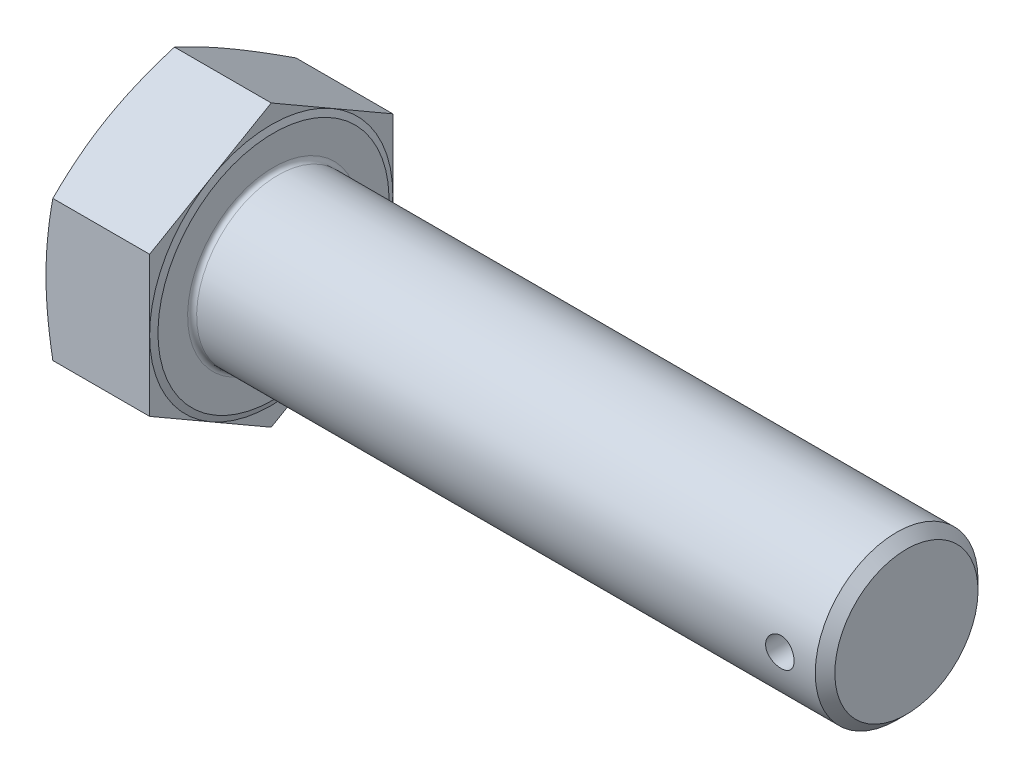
ISO-10303-21;
HEADER;
FILE_DESCRIPTION(('STEP AP214'),'2;1');
FILE_NAME('part.step','',(''),(''),'','','');
FILE_SCHEMA(('AUTOMOTIVE_DESIGN { 1 0 10303 214 1 1 1 1 }'));
ENDSEC;
DATA;
#1=APPLICATION_CONTEXT('core data for automotive mechanical design processes');
#2=APPLICATION_PROTOCOL_DEFINITION('international standard','automotive_design',2000,#1);
#3=PRODUCT_CONTEXT('',#1,'mechanical');
#4=PRODUCT('Part','Part','',(#3));
#5=PRODUCT_RELATED_PRODUCT_CATEGORY('part','',(#4));
#6=PRODUCT_DEFINITION_FORMATION('','',#4);
#7=PRODUCT_DEFINITION_CONTEXT('part definition',#1,'design');
#8=PRODUCT_DEFINITION('design','',#6,#7);
#9=PRODUCT_DEFINITION_SHAPE('','',#8);
#10=(LENGTH_UNIT() NAMED_UNIT(*) SI_UNIT(.MILLI.,.METRE.));
#11=(NAMED_UNIT(*) PLANE_ANGLE_UNIT() SI_UNIT($,.RADIAN.));
#12=(NAMED_UNIT(*) SI_UNIT($,.STERADIAN.) SOLID_ANGLE_UNIT());
#13=UNCERTAINTY_MEASURE_WITH_UNIT(LENGTH_MEASURE(1.E-05),#10,'distance_accuracy_value','');
#14=(GEOMETRIC_REPRESENTATION_CONTEXT(3) GLOBAL_UNCERTAINTY_ASSIGNED_CONTEXT((#13)) GLOBAL_UNIT_ASSIGNED_CONTEXT((#10,
#11,#12)) REPRESENTATION_CONTEXT('',''));
#15=CARTESIAN_POINT('',(0.,0.,0.));
#16=DIRECTION('',(0.,0.,1.));
#17=DIRECTION('',(1.,0.,0.));
#18=AXIS2_PLACEMENT_3D('',#15,#16,#17);
#19=CARTESIAN_POINT('',(23.42,0.,0.));
#20=DIRECTION('',(-1.,0.,0.));
#21=DIRECTION('',(0.,-1.,0.));
#22=AXIS2_PLACEMENT_3D('',#19,#20,#21);
#23=PLANE('',#22);
#24=CARTESIAN_POINT('',(23.42,0.,0.));
#25=DIRECTION('',(-1.,0.,0.));
#26=DIRECTION('',(0.,-1.,0.));
#27=AXIS2_PLACEMENT_3D('',#24,#25,#26);
#28=CIRCLE('',#27,19.);
#29=CARTESIAN_POINT('',(23.42,-19.,0.));
#30=VERTEX_POINT('',#29);
#31=EDGE_CURVE('E11',#30,#30,#28,.T.);
#32=ORIENTED_EDGE('',*,*,#31,.T.);
#33=EDGE_LOOP('',(#32));
#34=FACE_BOUND('',#33,.T.);
#35=CARTESIAN_POINT('',(23.42,0.,0.));
#36=DIRECTION('',(-1.,0.,0.));
#37=DIRECTION('',(0.,-1.,0.));
#38=AXIS2_PLACEMENT_3D('',#35,#36,#37);
#39=CIRCLE('',#38,25.555);
#40=CARTESIAN_POINT('',(23.42,-25.555,0.));
#41=VERTEX_POINT('',#40);
#42=EDGE_CURVE('E146',#41,#41,#39,.T.);
#43=ORIENTED_EDGE('',*,*,#42,.F.);
#44=EDGE_LOOP('',(#43));
#45=FACE_BOUND('',#44,.T.);
#46=ADVANCED_FACE('F32',(#34,#45),#23,.F.);
#47=CARTESIAN_POINT('',(22.92,0.,53.8));
#48=DIRECTION('',(-1.,0.,0.));
#49=DIRECTION('',(0.,0.,1.));
#50=AXIS2_PLACEMENT_3D('',#47,#48,#49);
#51=PLANE('',#50);
#52=DIRECTION('',(0.,-0.5,-0.866025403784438));
#53=VECTOR('',#52,1.);
#54=CARTESIAN_POINT('',(22.92,-15.5307222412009,26.9));
#55=LINE('',#54,#53);
#56=CARTESIAN_POINT('',(22.92,-15.5307222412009,26.9));
#57=VERTEX_POINT('',#56);
#58=CARTESIAN_POINT('',(22.92,-23.2960833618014,13.45));
#59=VERTEX_POINT('',#58);
#60=EDGE_CURVE('E145',#57,#59,#55,.T.);
#61=ORIENTED_EDGE('',*,*,#60,.T.);
#62=CARTESIAN_POINT('',(22.92,0.,0.));
#63=DIRECTION('',(-1.,0.,0.));
#64=DIRECTION('',(0.,-1.,0.));
#65=AXIS2_PLACEMENT_3D('',#62,#63,#64);
#66=CIRCLE('',#65,26.9);
#67=CARTESIAN_POINT('',(22.92,0.,26.9));
#68=VERTEX_POINT('',#67);
#69=EDGE_CURVE('E54',#59,#68,#66,.T.);
#70=ORIENTED_EDGE('',*,*,#69,.T.);
#71=DIRECTION('',(0.,-1.,0.));
#72=VECTOR('',#71,1.);
#73=CARTESIAN_POINT('',(22.92,15.530722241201,26.9));
#74=LINE('',#73,#72);
#75=EDGE_CURVE('E142',#68,#57,#74,.T.);
#76=ORIENTED_EDGE('',*,*,#75,.T.);
#77=EDGE_LOOP('',(#61,#70,#76));
#78=FACE_BOUND('',#77,.T.);
#79=ADVANCED_FACE('F141',(#78),#51,.F.);
#80=CARTESIAN_POINT('',(22.92,15.530722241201,26.9));
#81=VERTEX_POINT('',#80);
#82=EDGE_CURVE('E153',#81,#68,#74,.T.);
#83=ORIENTED_EDGE('',*,*,#82,.T.);
#84=CARTESIAN_POINT('',(22.92,23.2960833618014,13.45));
#85=VERTEX_POINT('',#84);
#86=EDGE_CURVE('E128',#68,#85,#66,.T.);
#87=ORIENTED_EDGE('',*,*,#86,.T.);
#88=DIRECTION('',(0.,-0.5,0.866025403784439));
#89=VECTOR('',#88,1.);
#90=CARTESIAN_POINT('',(22.92,31.0614444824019,0.));
#91=LINE('',#90,#89);
#92=EDGE_CURVE('E159',#85,#81,#91,.T.);
#93=ORIENTED_EDGE('',*,*,#92,.T.);
#94=EDGE_LOOP('',(#83,#87,#93));
#95=FACE_BOUND('',#94,.T.);
#96=ADVANCED_FACE('F158',(#95),#51,.F.);
#97=CARTESIAN_POINT('',(22.92,31.0614444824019,0.));
#98=VERTEX_POINT('',#97);
#99=EDGE_CURVE('E156',#98,#85,#91,.T.);
#100=ORIENTED_EDGE('',*,*,#99,.T.);
#101=CARTESIAN_POINT('',(22.92,23.2960833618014,-13.45));
#102=VERTEX_POINT('',#101);
#103=EDGE_CURVE('E132',#85,#102,#66,.T.);
#104=ORIENTED_EDGE('',*,*,#103,.T.);
#105=DIRECTION('',(0.,0.5,0.866025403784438));
#106=VECTOR('',#105,1.);
#107=CARTESIAN_POINT('',(22.92,15.530722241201,-26.9));
#108=LINE('',#107,#106);
#109=EDGE_CURVE('E325',#102,#98,#108,.T.);
#110=ORIENTED_EDGE('',*,*,#109,.T.);
#111=EDGE_LOOP('',(#100,#104,#110));
#112=FACE_BOUND('',#111,.T.);
#113=ADVANCED_FACE('F314',(#112),#51,.F.);
#114=CARTESIAN_POINT('',(22.92,15.530722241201,-26.9));
#115=VERTEX_POINT('',#114);
#116=EDGE_CURVE('E328',#115,#102,#108,.T.);
#117=ORIENTED_EDGE('',*,*,#116,.T.);
#118=CARTESIAN_POINT('',(22.92,0.,-26.9));
#119=VERTEX_POINT('',#118);
#120=EDGE_CURVE('E386',#102,#119,#66,.T.);
#121=ORIENTED_EDGE('',*,*,#120,.T.);
#122=DIRECTION('',(0.,1.,0.));
#123=VECTOR('',#122,1.);
#124=CARTESIAN_POINT('',(22.92,-15.5307222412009,-26.9));
#125=LINE('',#124,#123);
#126=EDGE_CURVE('E326',#119,#115,#125,.T.);
#127=ORIENTED_EDGE('',*,*,#126,.T.);
#128=EDGE_LOOP('',(#117,#121,#127));
#129=FACE_BOUND('',#128,.T.);
#130=ADVANCED_FACE('F307',(#129),#51,.F.);
#131=CARTESIAN_POINT('',(22.92,-15.5307222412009,-26.9));
#132=VERTEX_POINT('',#131);
#133=EDGE_CURVE('E319',#132,#119,#125,.T.);
#134=ORIENTED_EDGE('',*,*,#133,.T.);
#135=CARTESIAN_POINT('',(22.92,-23.2960833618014,-13.45));
#136=VERTEX_POINT('',#135);
#137=EDGE_CURVE('E320',#119,#136,#66,.T.);
#138=ORIENTED_EDGE('',*,*,#137,.T.);
#139=DIRECTION('',(0.,0.5,-0.866025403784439));
#140=VECTOR('',#139,1.);
#141=CARTESIAN_POINT('',(22.92,-31.0614444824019,0.));
#142=LINE('',#141,#140);
#143=EDGE_CURVE('E322',#136,#132,#142,.T.);
#144=ORIENTED_EDGE('',*,*,#143,.T.);
#145=EDGE_LOOP('',(#134,#138,#144));
#146=FACE_BOUND('',#145,.T.);
#147=ADVANCED_FACE('F299',(#146),#51,.F.);
#148=CARTESIAN_POINT('',(22.92,-15.5307222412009,26.9));
#149=DIRECTION('',(0.,0.866025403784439,-0.5));
#150=DIRECTION('',(0.,0.5,0.866025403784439));
#151=AXIS2_PLACEMENT_3D('',#148,#149,#150);
#152=PLANE('',#151);
#153=CARTESIAN_POINT('',(1.51468395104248,-31.0615599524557,-0.000199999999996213));
#154=CARTESIAN_POINT('',(1.397628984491,-30.739929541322,0.556880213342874));
#155=CARTESIAN_POINT('',(1.2858383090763,-30.4178264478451,1.11477913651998));
#156=CARTESIAN_POINT('',(1.07394359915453,-29.7726310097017,2.23229041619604));
#157=CARTESIAN_POINT('',(0.973840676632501,-29.4495385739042,2.79190293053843));
#158=CARTESIAN_POINT('',(0.692703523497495,-28.4783559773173,4.47404053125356));
#159=CARTESIAN_POINT('',(0.531005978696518,-27.8288051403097,5.5990955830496));
#160=CARTESIAN_POINT('',(0.33449307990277,-26.8553014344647,7.28525346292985));
#161=CARTESIAN_POINT('',(0.276827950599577,-26.5324717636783,7.84441085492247));
#162=CARTESIAN_POINT('',(0.177241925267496,-25.8861947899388,8.96379540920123));
#163=CARTESIAN_POINT('',(0.135321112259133,-25.5627474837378,9.52402257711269));
#164=CARTESIAN_POINT('',(0.067960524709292,-24.9155418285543,10.6450156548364));
#165=CARTESIAN_POINT('',(0.0425147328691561,-24.5917836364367,11.2057812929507));
#166=CARTESIAN_POINT('',(0.00853449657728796,-23.9440447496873,12.3276979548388));
#167=CARTESIAN_POINT('',(0.,-23.6200640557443,12.8888489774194));
#168=CARTESIAN_POINT('',(0.,-22.9721026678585,14.0111510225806));
#169=CARTESIAN_POINT('',(0.00853449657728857,-22.6481219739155,14.5723020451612));
#170=CARTESIAN_POINT('',(0.0425147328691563,-22.0003830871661,15.6942187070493));
#171=CARTESIAN_POINT('',(0.0679605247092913,-21.6766248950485,16.2549843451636));
#172=CARTESIAN_POINT('',(0.135321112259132,-21.029419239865,17.3759774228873));
#173=CARTESIAN_POINT('',(0.177241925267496,-20.705971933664,17.9362045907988));
#174=CARTESIAN_POINT('',(0.276827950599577,-20.0596949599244,19.0555891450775));
#175=CARTESIAN_POINT('',(0.334493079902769,-19.7368652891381,19.6147465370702));
#176=CARTESIAN_POINT('',(0.531005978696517,-18.7633615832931,21.3009044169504));
#177=CARTESIAN_POINT('',(0.692703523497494,-18.1138107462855,22.4259594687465));
#178=CARTESIAN_POINT('',(0.9738406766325,-17.1426281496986,24.1080970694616));
#179=CARTESIAN_POINT('',(1.07394359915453,-16.8195357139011,24.667709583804));
#180=CARTESIAN_POINT('',(1.28583830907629,-16.1743402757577,25.78522086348));
#181=CARTESIAN_POINT('',(1.39762898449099,-15.8522371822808,26.3431197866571));
#182=CARTESIAN_POINT('',(1.51468395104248,-15.5306067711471,26.9002));
#183=B_SPLINE_CURVE_WITH_KNOTS('',3,(#153,#154,#155,#156,#157,#158,#159,#160,#161,#162,#163,
#164,#165,#166,#167,#168,#169,#170,#171,#172,#173,#174,#175,#176,#177,#178,#179,#180,#181,#182),
.UNSPECIFIED.,.F.,.F.,(4,2,2,2,2,2,2,2,2,2,2,2,2,2,4),(0.,1.96141494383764,3.92301634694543,
7.84893078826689,9.79346540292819,11.7380102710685,13.6818445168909,15.6256727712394,
17.569501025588,19.5133352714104,21.4578801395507,23.402414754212,27.3283291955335,
29.2899305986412,31.2513455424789),.UNSPECIFIED.);
#184=CARTESIAN_POINT('',(1.51464192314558,-31.0614444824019,0.));
#185=VERTEX_POINT('',#184);
#186=CARTESIAN_POINT('',(0.,-23.2960833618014,13.45));
#187=VERTEX_POINT('',#186);
#188=EDGE_CURVE('E367',#185,#187,#183,.T.);
#189=ORIENTED_EDGE('',*,*,#188,.F.);
#190=DIRECTION('',(-1.,0.,0.));
#191=VECTOR('',#190,1.);
#192=CARTESIAN_POINT('',(22.92,-31.0614444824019,0.));
#193=LINE('',#192,#191);
#194=CARTESIAN_POINT('',(22.92,-31.0614444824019,0.));
#195=VERTEX_POINT('',#194);
#196=EDGE_CURVE('E176',#195,#185,#193,.T.);
#197=ORIENTED_EDGE('',*,*,#196,.F.);
#198=EDGE_CURVE('E375',#59,#195,#55,.T.);
#199=ORIENTED_EDGE('',*,*,#198,.F.);
#200=ORIENTED_EDGE('',*,*,#60,.F.);
#201=DIRECTION('',(-1.,0.,0.));
#202=VECTOR('',#201,1.);
#203=CARTESIAN_POINT('',(22.92,-15.5307222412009,26.9));
#204=LINE('',#203,#202);
#205=CARTESIAN_POINT('',(1.51464192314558,-15.530722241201,26.9));
#206=VERTEX_POINT('',#205);
#207=EDGE_CURVE('E155',#57,#206,#204,.T.);
#208=ORIENTED_EDGE('',*,*,#207,.T.);
#209=EDGE_CURVE('E256',#187,#206,#183,.T.);
#210=ORIENTED_EDGE('',*,*,#209,.F.);
#211=EDGE_LOOP('',(#189,#197,#199,#200,#208,#210));
#212=FACE_BOUND('',#211,.T.);
#213=ADVANCED_FACE('F34',(#212),#152,.F.);
#214=CARTESIAN_POINT('',(22.92,-31.0614444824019,0.));
#215=DIRECTION('',(0.,0.866025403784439,0.5));
#216=DIRECTION('',(0.,-0.5,0.866025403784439));
#217=AXIS2_PLACEMENT_3D('',#214,#215,#216);
#218=PLANE('',#217);
#219=CARTESIAN_POINT('',(1.51468395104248,-15.5306067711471,-26.9002));
#220=CARTESIAN_POINT('',(1.397628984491,-15.8522371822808,-26.3431197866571));
#221=CARTESIAN_POINT('',(1.2858383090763,-16.1743402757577,-25.78522086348));
#222=CARTESIAN_POINT('',(1.07394359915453,-16.8195357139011,-24.667709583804));
#223=CARTESIAN_POINT('',(0.9738406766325,-17.1426281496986,-24.1080970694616));
#224=CARTESIAN_POINT('',(0.692703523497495,-18.1138107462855,-22.4259594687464));
#225=CARTESIAN_POINT('',(0.531005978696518,-18.7633615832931,-21.3009044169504));
#226=CARTESIAN_POINT('',(0.334493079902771,-19.7368652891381,-19.6147465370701));
#227=CARTESIAN_POINT('',(0.276827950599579,-20.0596949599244,-19.0555891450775));
#228=CARTESIAN_POINT('',(0.177241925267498,-20.705971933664,-17.9362045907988));
#229=CARTESIAN_POINT('',(0.135321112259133,-21.029419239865,-17.3759774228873));
#230=CARTESIAN_POINT('',(0.0679605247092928,-21.6766248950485,-16.2549843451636));
#231=CARTESIAN_POINT('',(0.0425147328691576,-22.0003830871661,-15.6942187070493));
#232=CARTESIAN_POINT('',(0.00853449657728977,-22.6481219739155,-14.5723020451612));
#233=CARTESIAN_POINT('',(0.,-22.9721026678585,-14.0111510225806));
#234=CARTESIAN_POINT('',(0.,-23.6200640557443,-12.8888489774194));
#235=CARTESIAN_POINT('',(0.00853449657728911,-23.9440447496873,-12.3276979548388));
#236=CARTESIAN_POINT('',(0.0425147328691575,-24.5917836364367,-11.2057812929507));
#237=CARTESIAN_POINT('',(0.0679605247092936,-24.9155418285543,-10.6450156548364));
#238=CARTESIAN_POINT('',(0.135321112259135,-25.5627474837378,-9.52402257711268));
#239=CARTESIAN_POINT('',(0.177241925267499,-25.8861947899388,-8.96379540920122));
#240=CARTESIAN_POINT('',(0.27682795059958,-26.5324717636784,-7.84441085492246));
#241=CARTESIAN_POINT('',(0.334493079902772,-26.8553014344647,-7.28525346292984));
#242=CARTESIAN_POINT('',(0.531005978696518,-27.8288051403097,-5.59909558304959));
#243=CARTESIAN_POINT('',(0.692703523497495,-28.4783559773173,-4.47404053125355));
#244=CARTESIAN_POINT('',(0.973840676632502,-29.4495385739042,-2.79190293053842));
#245=CARTESIAN_POINT('',(1.07394359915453,-29.7726310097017,-2.23229041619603));
#246=CARTESIAN_POINT('',(1.2858383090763,-30.4178264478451,-1.11477913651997));
#247=CARTESIAN_POINT('',(1.397628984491,-30.739929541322,-0.556880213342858));
#248=CARTESIAN_POINT('',(1.51468395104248,-31.0615599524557,0.000200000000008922));
#249=B_SPLINE_CURVE_WITH_KNOTS('',3,(#219,#220,#221,#222,#223,#224,#225,#226,#227,#228,#229,
#230,#231,#232,#233,#234,#235,#236,#237,#238,#239,#240,#241,#242,#243,#244,#245,#246,#247,#248),
.UNSPECIFIED.,.F.,.F.,(4,2,2,2,2,2,2,2,2,2,2,2,2,2,4),(0.,1.96141494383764,3.92301634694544,
7.84893078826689,9.79346540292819,11.7380102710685,13.6818445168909,15.6256727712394,
17.569501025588,19.5133352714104,21.4578801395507,23.402414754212,27.3283291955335,
29.2899305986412,31.2513455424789),.UNSPECIFIED.);
#250=CARTESIAN_POINT('',(1.51464192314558,-15.530722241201,-26.9));
#251=VERTEX_POINT('',#250);
#252=CARTESIAN_POINT('',(0.,-23.2960833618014,-13.45));
#253=VERTEX_POINT('',#252);
#254=EDGE_CURVE('E271',#251,#253,#249,.T.);
#255=ORIENTED_EDGE('',*,*,#254,.F.);
#256=DIRECTION('',(-1.,0.,0.));
#257=VECTOR('',#256,1.);
#258=CARTESIAN_POINT('',(22.92,-15.5307222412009,-26.9));
#259=LINE('',#258,#257);
#260=EDGE_CURVE('E173',#132,#251,#259,.T.);
#261=ORIENTED_EDGE('',*,*,#260,.F.);
#262=ORIENTED_EDGE('',*,*,#143,.F.);
#263=EDGE_CURVE('E329',#195,#136,#142,.T.);
#264=ORIENTED_EDGE('',*,*,#263,.F.);
#265=ORIENTED_EDGE('',*,*,#196,.T.);
#266=EDGE_CURVE('E267',#253,#185,#249,.T.);
#267=ORIENTED_EDGE('',*,*,#266,.F.);
#268=EDGE_LOOP('',(#255,#261,#262,#264,#265,#267));
#269=FACE_BOUND('',#268,.T.);
#270=ADVANCED_FACE('F278',(#269),#218,.F.);
#271=CARTESIAN_POINT('',(22.92,-15.5307222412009,-26.9));
#272=DIRECTION('',(0.,0.,1.));
#273=DIRECTION('',(0.,-1.,0.));
#274=AXIS2_PLACEMENT_3D('',#271,#272,#273);
#275=PLANE('',#274);
#276=CARTESIAN_POINT('',(8.09364721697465,-41.1198962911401,-26.9));
#277=CARTESIAN_POINT('',(7.90830575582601,-40.5113784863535,-26.9));
#278=CARTESIAN_POINT('',(7.72408515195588,-39.90251948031,-26.9));
#279=CARTESIAN_POINT('',(7.35813658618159,-38.6840491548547,-26.9));
#280=CARTESIAN_POINT('',(7.17640863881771,-38.074437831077,-26.9));
#281=CARTESIAN_POINT('',(6.63531674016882,-36.2442909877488,-26.9));
#282=CARTESIAN_POINT('',(6.28007220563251,-35.0225325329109,-26.9));
#283=CARTESIAN_POINT('',(5.58244845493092,-32.5728740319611,-26.9));
#284=CARTESIAN_POINT('',(5.24009447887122,-31.3449667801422,-26.9));
#285=CARTESIAN_POINT('',(4.57223055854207,-28.8845851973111,-26.9));
#286=CARTESIAN_POINT('',(4.24672031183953,-27.6521109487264,-26.9));
#287=CARTESIAN_POINT('',(3.62060857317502,-25.1970031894,-26.9));
#288=CARTESIAN_POINT('',(3.31974945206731,-23.974435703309,-26.9));
#289=CARTESIAN_POINT('',(2.74364542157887,-21.5232168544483,-26.9));
#290=CARTESIAN_POINT('',(2.46840094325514,-20.2945653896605,-26.9));
#291=CARTESIAN_POINT('',(1.94994346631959,-17.8309048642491,-26.9));
#292=CARTESIAN_POINT('',(1.70671954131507,-16.5958981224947,-26.9));
#293=CARTESIAN_POINT('',(1.25971044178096,-14.1187108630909,-26.9));
#294=CARTESIAN_POINT('',(1.05592394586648,-12.8765305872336,-26.9));
#295=CARTESIAN_POINT('',(0.716241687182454,-10.5248875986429,-26.9));
#296=CARTESIAN_POINT('',(0.575295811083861,-9.41615979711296,-26.9));
#297=CARTESIAN_POINT('',(0.336719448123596,-7.19397286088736,-26.9));
#298=CARTESIAN_POINT('',(0.23908769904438,-6.08051386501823,-26.9));
#299=CARTESIAN_POINT('',(0.128594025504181,-4.40838527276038,-26.9));
#300=CARTESIAN_POINT('',(0.0977592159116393,-3.85086305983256,-26.9));
#301=CARTESIAN_POINT('',(0.0484240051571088,-2.73527749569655,-26.9));
#302=CARTESIAN_POINT('',(0.0299232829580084,-2.17721415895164,-26.9));
#303=CARTESIAN_POINT('',(0.00551073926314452,-1.06080794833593,-26.9));
#304=CARTESIAN_POINT('',(-0.000400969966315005,-0.50246507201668,-26.9));
#305=CARTESIAN_POINT('',(0.000443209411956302,0.61421121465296,-26.9));
#306=CARTESIAN_POINT('',(0.00719910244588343,1.17254462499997,-26.9));
#307=CARTESIAN_POINT('',(0.0333546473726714,2.29174015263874,-26.9));
#308=CARTESIAN_POINT('',(0.0528180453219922,2.85260078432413,-26.9));
#309=CARTESIAN_POINT('',(0.104179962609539,3.97375682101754,-26.9));
#310=CARTESIAN_POINT('',(0.136078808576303,4.53405221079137,-26.9));
#311=CARTESIAN_POINT('',(0.249841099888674,6.21369760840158,-26.9));
#312=CARTESIAN_POINT('',(0.349771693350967,7.33186346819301,-26.9));
#313=CARTESIAN_POINT('',(0.593196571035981,9.56430548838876,-26.9));
#314=CARTESIAN_POINT('',(0.73672827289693,10.6785774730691,-26.9));
#315=CARTESIAN_POINT('',(1.06151772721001,12.9015586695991,-26.9));
#316=CARTESIAN_POINT('',(1.2427756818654,14.010267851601,-26.9));
#317=CARTESIAN_POINT('',(1.64755285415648,16.2804505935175,-26.9));
#318=CARTESIAN_POINT('',(1.87280034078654,17.4416130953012,-26.9));
#319=CARTESIAN_POINT('',(2.35228571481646,19.7579761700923,-26.9));
#320=CARTESIAN_POINT('',(2.60652578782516,20.9131762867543,-26.9));
#321=CARTESIAN_POINT('',(3.13865814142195,23.2184366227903,-26.9));
#322=CARTESIAN_POINT('',(3.41655729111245,24.368495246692,-26.9));
#323=CARTESIAN_POINT('',(3.99148711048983,26.6637678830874,-26.9));
#324=CARTESIAN_POINT('',(4.2885173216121,27.8089820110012,-26.9));
#325=CARTESIAN_POINT('',(4.89852470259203,30.0967154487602,-26.9));
#326=CARTESIAN_POINT('',(5.21152186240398,31.2392294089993,-26.9));
#327=CARTESIAN_POINT('',(5.85024857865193,33.5206878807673,-26.9));
#328=CARTESIAN_POINT('',(6.17597818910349,34.6596323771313,-26.9));
#329=CARTESIAN_POINT('',(6.83783935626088,36.934281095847,-26.9));
#330=CARTESIAN_POINT('',(7.17396915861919,38.0699858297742,-26.9));
#331=CARTESIAN_POINT('',(7.85487572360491,40.3387931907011,-26.9));
#332=CARTESIAN_POINT('',(8.19965246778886,41.4718958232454,-26.9));
#333=CARTESIAN_POINT('',(8.89256632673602,43.7233823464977,-26.9));
#334=CARTESIAN_POINT('',(9.24062431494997,44.8417906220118,-26.9));
#335=CARTESIAN_POINT('',(9.94266917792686,47.0767430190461,-26.9));
#336=CARTESIAN_POINT('',(10.2966560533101,48.1932871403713,-26.9));
#337=CARTESIAN_POINT('',(11.0096682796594,50.4248205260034,-26.9));
#338=CARTESIAN_POINT('',(11.3686938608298,51.5398097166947,-26.9));
#339=CARTESIAN_POINT('',(12.0910290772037,53.7683997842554,-26.9));
#340=CARTESIAN_POINT('',(12.4543387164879,54.8820006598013,-26.9));
#341=CARTESIAN_POINT('',(13.183249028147,57.1037705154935,-26.9));
#342=CARTESIAN_POINT('',(13.5488357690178,58.2119440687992,-26.9));
#343=CARTESIAN_POINT('',(14.2831639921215,60.4272456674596,-26.9));
#344=CARTESIAN_POINT('',(14.6519054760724,61.5343737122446,-26.9));
#345=CARTESIAN_POINT('',(15.3920970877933,63.7476227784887,-26.9));
#346=CARTESIAN_POINT('',(15.7635469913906,64.8537438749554,-26.9));
#347=CARTESIAN_POINT('',(16.5088503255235,67.0651731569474,-26.9));
#348=CARTESIAN_POINT('',(16.8827037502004,68.170481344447,-26.9));
#349=CARTESIAN_POINT('',(17.2575923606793,69.2754374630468,-26.9));
#350=B_SPLINE_CURVE_WITH_KNOTS('',3,(#276,#277,#278,#279,#280,#281,#282,#283,#284,#285,#286,
#287,#288,#289,#290,#291,#292,#293,#294,#295,#296,#297,#298,#299,#300,#301,#302,#303,#304,#305,
#306,#307,#308,#309,#310,#311,#312,#313,#314,#315,#316,#317,#318,#319,#320,#321,#322,#323,#324,
#325,#326,#327,#328,#329,#330,#331,#332,#333,#334,#335,#336,#337,#338,#339,#340,#341,#342,#343,
#344,#345,#346,#347,#348,#349),.UNSPECIFIED.,.F.,.F.,(4,2,2,2,2,2,2,2,2,2,2,2,2,2,2,2,2,2,2,2,2,
2,2,2,2,2,2,2,2,2,2,2,2,2,2,2,4),(0.,1.90835024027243,3.81671160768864,7.63371645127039,
11.4578428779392,15.2819006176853,19.058809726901,22.8357823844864,26.6114628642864,
30.387016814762,33.7392585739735,37.0914026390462,38.7664112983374,40.4413763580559,
42.1163563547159,43.791336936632,45.4747851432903,47.1582775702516,50.5250926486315,
53.8948052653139,57.2645359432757,60.812508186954,64.3607480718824,67.9100216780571,
71.4592102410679,75.0129568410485,78.5667185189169,82.1198839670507,85.6730418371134,
89.186970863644,92.700900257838,96.214990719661,99.7290845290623,103.229839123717,
106.73059562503,110.231065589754,113.731527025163),.UNSPECIFIED.);
#351=CARTESIAN_POINT('',(1.51464192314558,15.5307222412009,-26.9));
#352=VERTEX_POINT('',#351);
#353=CARTESIAN_POINT('',(0.,0.,-26.9));
#354=VERTEX_POINT('',#353);
#355=EDGE_CURVE('E376',#352,#354,#350,.F.);
#356=ORIENTED_EDGE('',*,*,#355,.F.);
#357=DIRECTION('',(-1.,0.,0.));
#358=VECTOR('',#357,1.);
#359=CARTESIAN_POINT('',(22.92,15.530722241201,-26.9));
#360=LINE('',#359,#358);
#361=EDGE_CURVE('E170',#115,#352,#360,.T.);
#362=ORIENTED_EDGE('',*,*,#361,.F.);
#363=ORIENTED_EDGE('',*,*,#126,.F.);
#364=ORIENTED_EDGE('',*,*,#133,.F.);
#365=ORIENTED_EDGE('',*,*,#260,.T.);
#366=EDGE_CURVE('E272',#354,#251,#350,.F.);
#367=ORIENTED_EDGE('',*,*,#366,.F.);
#368=EDGE_LOOP('',(#356,#362,#363,#364,#365,#367));
#369=FACE_BOUND('',#368,.T.);
#370=ADVANCED_FACE('F281',(#369),#275,.F.);
#371=CARTESIAN_POINT('',(22.92,15.530722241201,-26.9));
#372=DIRECTION('',(0.,-0.866025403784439,0.5));
#373=DIRECTION('',(0.,-0.5,-0.866025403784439));
#374=AXIS2_PLACEMENT_3D('',#371,#372,#373);
#375=PLANE('',#374);
#376=CARTESIAN_POINT('',(1.51468395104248,31.0615599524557,0.000199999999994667));
#377=CARTESIAN_POINT('',(1.39762898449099,30.739929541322,-0.556880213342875));
#378=CARTESIAN_POINT('',(1.28583830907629,30.4178264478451,-1.11477913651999));
#379=CARTESIAN_POINT('',(1.07394359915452,29.7726310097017,-2.23229041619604));
#380=CARTESIAN_POINT('',(0.973840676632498,29.4495385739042,-2.79190293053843));
#381=CARTESIAN_POINT('',(0.692703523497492,28.4783559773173,-4.47404053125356));
#382=CARTESIAN_POINT('',(0.531005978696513,27.8288051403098,-5.5990955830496));
#383=CARTESIAN_POINT('',(0.334493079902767,26.8553014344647,-7.28525346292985));
#384=CARTESIAN_POINT('',(0.276827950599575,26.5324717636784,-7.84441085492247));
#385=CARTESIAN_POINT('',(0.177241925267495,25.8861947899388,-8.96379540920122));
#386=CARTESIAN_POINT('',(0.135321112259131,25.5627474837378,-9.52402257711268));
#387=CARTESIAN_POINT('',(0.0679605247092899,24.9155418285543,-10.6450156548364));
#388=CARTESIAN_POINT('',(0.0425147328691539,24.5917836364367,-11.2057812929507));
#389=CARTESIAN_POINT('',(0.00853449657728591,23.9440447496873,-12.3276979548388));
#390=CARTESIAN_POINT('',(0.,23.6200640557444,-12.8888489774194));
#391=CARTESIAN_POINT('',(0.,22.9721026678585,-14.0111510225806));
#392=CARTESIAN_POINT('',(0.0085344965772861,22.6481219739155,-14.5723020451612));
#393=CARTESIAN_POINT('',(0.0425147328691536,22.0003830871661,-15.6942187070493));
#394=CARTESIAN_POINT('',(0.067960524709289,21.6766248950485,-16.2549843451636));
#395=CARTESIAN_POINT('',(0.13532111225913,21.029419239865,-17.3759774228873));
#396=CARTESIAN_POINT('',(0.177241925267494,20.705971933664,-17.9362045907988));
#397=CARTESIAN_POINT('',(0.276827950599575,20.0596949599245,-19.0555891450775));
#398=CARTESIAN_POINT('',(0.334493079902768,19.7368652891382,-19.6147465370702));
#399=CARTESIAN_POINT('',(0.531005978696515,18.7633615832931,-21.3009044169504));
#400=CARTESIAN_POINT('',(0.692703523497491,18.1138107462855,-22.4259594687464));
#401=CARTESIAN_POINT('',(0.973840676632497,17.1426281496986,-24.1080970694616));
#402=CARTESIAN_POINT('',(1.07394359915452,16.8195357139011,-24.667709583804));
#403=CARTESIAN_POINT('',(1.28583830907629,16.1743402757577,-25.78522086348));
#404=CARTESIAN_POINT('',(1.39762898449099,15.8522371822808,-26.3431197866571));
#405=CARTESIAN_POINT('',(1.51468395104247,15.5306067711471,-26.9002));
#406=B_SPLINE_CURVE_WITH_KNOTS('',3,(#376,#377,#378,#379,#380,#381,#382,#383,#384,#385,#386,
#387,#388,#389,#390,#391,#392,#393,#394,#395,#396,#397,#398,#399,#400,#401,#402,#403,#404,#405),
.UNSPECIFIED.,.F.,.F.,(4,2,2,2,2,2,2,2,2,2,2,2,2,2,4),(0.,1.96141494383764,3.92301634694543,
7.84893078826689,9.79346540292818,11.7380102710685,13.6818445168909,15.6256727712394,
17.5695010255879,19.5133352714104,21.4578801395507,23.402414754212,27.3283291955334,
29.2899305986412,31.2513455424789),.UNSPECIFIED.);
#407=CARTESIAN_POINT('',(1.51464192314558,31.0614444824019,0.));
#408=VERTEX_POINT('',#407);
#409=CARTESIAN_POINT('',(0.,23.2960833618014,-13.45));
#410=VERTEX_POINT('',#409);
#411=EDGE_CURVE('E261',#408,#410,#406,.T.);
#412=ORIENTED_EDGE('',*,*,#411,.F.);
#413=DIRECTION('',(-1.,0.,0.));
#414=VECTOR('',#413,1.);
#415=CARTESIAN_POINT('',(22.92,31.0614444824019,0.));
#416=LINE('',#415,#414);
#417=EDGE_CURVE('E167',#98,#408,#416,.T.);
#418=ORIENTED_EDGE('',*,*,#417,.F.);
#419=ORIENTED_EDGE('',*,*,#109,.F.);
#420=ORIENTED_EDGE('',*,*,#116,.F.);
#421=ORIENTED_EDGE('',*,*,#361,.T.);
#422=EDGE_CURVE('E368',#410,#352,#406,.T.);
#423=ORIENTED_EDGE('',*,*,#422,.F.);
#424=EDGE_LOOP('',(#412,#418,#419,#420,#421,#423));
#425=FACE_BOUND('',#424,.T.);
#426=ADVANCED_FACE('F285',(#425),#375,.F.);
#427=CARTESIAN_POINT('',(22.92,31.0614444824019,0.));
#428=DIRECTION('',(0.,-0.866025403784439,-0.5));
#429=DIRECTION('',(0.,0.5,-0.866025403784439));
#430=AXIS2_PLACEMENT_3D('',#427,#428,#429);
#431=PLANE('',#430);
#432=CARTESIAN_POINT('',(1.51468395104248,15.5306067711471,26.9002));
#433=CARTESIAN_POINT('',(1.39762898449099,15.8522371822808,26.3431197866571));
#434=CARTESIAN_POINT('',(1.28583830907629,16.1743402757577,25.78522086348));
#435=CARTESIAN_POINT('',(1.07394359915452,16.8195357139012,24.667709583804));
#436=CARTESIAN_POINT('',(0.973840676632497,17.1426281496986,24.1080970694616));
#437=CARTESIAN_POINT('',(0.692703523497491,18.1138107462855,22.4259594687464));
#438=CARTESIAN_POINT('',(0.531005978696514,18.7633615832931,21.3009044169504));
#439=CARTESIAN_POINT('',(0.334493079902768,19.7368652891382,19.6147465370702));
#440=CARTESIAN_POINT('',(0.276827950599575,20.0596949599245,19.0555891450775));
#441=CARTESIAN_POINT('',(0.177241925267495,20.705971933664,17.9362045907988));
#442=CARTESIAN_POINT('',(0.135321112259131,21.029419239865,17.3759774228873));
#443=CARTESIAN_POINT('',(0.0679605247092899,21.6766248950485,16.2549843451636));
#444=CARTESIAN_POINT('',(0.0425147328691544,22.0003830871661,15.6942187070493));
#445=CARTESIAN_POINT('',(0.00853449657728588,22.6481219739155,14.5723020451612));
#446=CARTESIAN_POINT('',(0.,22.9721026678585,14.0111510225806));
#447=CARTESIAN_POINT('',(0.,23.6200640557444,12.8888489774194));
#448=CARTESIAN_POINT('',(0.00853449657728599,23.9440447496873,12.3276979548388));
#449=CARTESIAN_POINT('',(0.0425147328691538,24.5917836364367,11.2057812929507));
#450=CARTESIAN_POINT('',(0.0679605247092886,24.9155418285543,10.6450156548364));
#451=CARTESIAN_POINT('',(0.13532111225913,25.5627474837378,9.52402257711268));
#452=CARTESIAN_POINT('',(0.177241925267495,25.8861947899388,8.96379540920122));
#453=CARTESIAN_POINT('',(0.276827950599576,26.5324717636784,7.84441085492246));
#454=CARTESIAN_POINT('',(0.334493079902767,26.8553014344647,7.28525346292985));
#455=CARTESIAN_POINT('',(0.531005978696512,27.8288051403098,5.59909558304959));
#456=CARTESIAN_POINT('',(0.692703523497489,28.4783559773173,4.47404053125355));
#457=CARTESIAN_POINT('',(0.973840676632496,29.4495385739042,2.79190293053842));
#458=CARTESIAN_POINT('',(1.07394359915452,29.7726310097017,2.23229041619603));
#459=CARTESIAN_POINT('',(1.28583830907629,30.4178264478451,1.11477913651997));
#460=CARTESIAN_POINT('',(1.39762898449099,30.739929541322,0.556880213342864));
#461=CARTESIAN_POINT('',(1.51468395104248,31.0615599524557,-0.000200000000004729));
#462=B_SPLINE_CURVE_WITH_KNOTS('',3,(#432,#433,#434,#435,#436,#437,#438,#439,#440,#441,#442,
#443,#444,#445,#446,#447,#448,#449,#450,#451,#452,#453,#454,#455,#456,#457,#458,#459,#460,#461),
.UNSPECIFIED.,.F.,.F.,(4,2,2,2,2,2,2,2,2,2,2,2,2,2,4),(0.,1.96141494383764,3.92301634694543,
7.84893078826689,9.79346540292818,11.7380102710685,13.6818445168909,15.6256727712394,
17.569501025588,19.5133352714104,21.4578801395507,23.402414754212,27.3283291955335,
29.2899305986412,31.2513455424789),.UNSPECIFIED.);
#463=CARTESIAN_POINT('',(1.51464192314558,15.530722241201,26.9));
#464=VERTEX_POINT('',#463);
#465=CARTESIAN_POINT('',(0.,23.2960833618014,13.45));
#466=VERTEX_POINT('',#465);
#467=EDGE_CURVE('E249',#464,#466,#462,.T.);
#468=ORIENTED_EDGE('',*,*,#467,.F.);
#469=DIRECTION('',(-1.,0.,0.));
#470=VECTOR('',#469,1.);
#471=CARTESIAN_POINT('',(22.92,15.530722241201,26.9));
#472=LINE('',#471,#470);
#473=EDGE_CURVE('E161',#81,#464,#472,.T.);
#474=ORIENTED_EDGE('',*,*,#473,.F.);
#475=ORIENTED_EDGE('',*,*,#92,.F.);
#476=ORIENTED_EDGE('',*,*,#99,.F.);
#477=ORIENTED_EDGE('',*,*,#417,.T.);
#478=EDGE_CURVE('E360',#466,#408,#462,.T.);
#479=ORIENTED_EDGE('',*,*,#478,.F.);
#480=EDGE_LOOP('',(#468,#474,#475,#476,#477,#479));
#481=FACE_BOUND('',#480,.T.);
#482=ADVANCED_FACE('F289',(#481),#431,.F.);
#483=CARTESIAN_POINT('',(22.92,15.530722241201,26.9));
#484=DIRECTION('',(0.,0.,-1.));
#485=DIRECTION('',(-1.,0.,0.));
#486=AXIS2_PLACEMENT_3D('',#483,#484,#485);
#487=PLANE('',#486);
#488=CARTESIAN_POINT('',(8.09364576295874,-41.1198915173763,26.9));
#489=CARTESIAN_POINT('',(7.90830433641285,-40.5113738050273,26.9));
#490=CARTESIAN_POINT('',(7.72408376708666,-39.9025148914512,26.9));
#491=CARTESIAN_POINT('',(7.35813527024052,-38.6840447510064,26.9));
#492=CARTESIAN_POINT('',(7.17640735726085,-38.0744335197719,26.9));
#493=CARTESIAN_POINT('',(6.63531556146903,-36.2442869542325,26.9));
#494=CARTESIAN_POINT('',(6.28007109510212,-35.0225286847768,26.9));
#495=CARTESIAN_POINT('',(5.58244747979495,-32.5728705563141,26.9));
#496=CARTESIAN_POINT('',(5.24009357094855,-31.3449634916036,26.9));
#497=CARTESIAN_POINT('',(4.5722297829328,-28.8845822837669,26.9));
#498=CARTESIAN_POINT('',(4.24671960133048,-27.6521082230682,26.9));
#499=CARTESIAN_POINT('',(3.62060798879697,-25.1970008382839,26.9));
#500=CARTESIAN_POINT('',(3.31974892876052,-23.9744335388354,26.9));
#501=CARTESIAN_POINT('',(2.74364501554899,-21.5232150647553,26.9));
#502=CARTESIAN_POINT('',(2.46840059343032,-20.2945637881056,26.9));
#503=CARTESIAN_POINT('',(1.94994322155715,-17.830903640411,26.9));
#504=CARTESIAN_POINT('',(1.70671934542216,-16.5958970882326,26.9));
#505=CARTESIAN_POINT('',(1.2597103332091,-14.118710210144,26.9));
#506=CARTESIAN_POINT('',(1.05592387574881,-12.8765301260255,26.9));
#507=CARTESIAN_POINT('',(0.716241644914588,-10.5248872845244,26.9));
#508=CARTESIAN_POINT('',(0.575295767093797,-9.41615943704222,26.9));
#509=CARTESIAN_POINT('',(0.336719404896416,-7.19397240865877,26.9));
#510=CARTESIAN_POINT('',(0.239087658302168,-6.080513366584,26.9));
#511=CARTESIAN_POINT('',(0.128593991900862,-4.40838470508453,26.9));
#512=CARTESIAN_POINT('',(0.0977591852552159,-3.85086246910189,26.9));
#513=CARTESIAN_POINT('',(0.0484239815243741,-2.73527685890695,26.9));
#514=CARTESIAN_POINT('',(0.0299232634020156,-2.17721349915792,26.9));
#515=CARTESIAN_POINT('',(0.00551072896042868,-1.06080724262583,26.9));
#516=CARTESIAN_POINT('',(-0.000400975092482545,-0.502464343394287,26.9));
#517=CARTESIAN_POINT('',(0.00044321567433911,0.614211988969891,26.9));
#518=CARTESIAN_POINT('',(0.00719911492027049,1.17254542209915,26.9));
#519=CARTESIAN_POINT('',(0.0333546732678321,2.29174099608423,26.9));
#520=CARTESIAN_POINT('',(0.0528180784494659,2.85260165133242,26.9));
#521=CARTESIAN_POINT('',(0.104180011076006,3.97375773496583,26.9));
#522=CARTESIAN_POINT('',(0.136078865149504,4.53405314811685,26.9));
#523=CARTESIAN_POINT('',(0.249841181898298,6.21369861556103,26.9));
#524=CARTESIAN_POINT('',(0.349771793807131,7.33186452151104,26.9));
#525=CARTESIAN_POINT('',(0.59319671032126,9.56430663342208,26.9));
#526=CARTESIAN_POINT('',(0.736728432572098,10.6785786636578,26.9));
#527=CARTESIAN_POINT('',(1.06151792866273,12.9015599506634,26.9));
#528=CARTESIAN_POINT('',(1.24277590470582,14.0102691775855,26.9));
#529=CARTESIAN_POINT('',(1.6475531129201,16.2804519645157,26.9));
#530=CARTESIAN_POINT('',(1.87280061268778,17.4416144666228,26.9));
#531=CARTESIAN_POINT('',(2.35228601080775,19.7579775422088,26.9));
#532=CARTESIAN_POINT('',(2.60652609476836,20.9131776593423,26.9));
#533=CARTESIAN_POINT('',(3.13865846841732,23.2184379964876,26.9));
#534=CARTESIAN_POINT('',(3.41655762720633,24.3684966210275,26.9));
#535=CARTESIAN_POINT('',(3.99148746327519,26.663769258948,26.9));
#536=CARTESIAN_POINT('',(4.28851768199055,27.8089833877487,26.9));
#537=CARTESIAN_POINT('',(4.89852507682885,30.0967168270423,26.9));
#538=CARTESIAN_POINT('',(5.21152224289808,31.2392307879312,26.9));
#539=CARTESIAN_POINT('',(5.85024897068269,33.5206892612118,26.9));
#540=CARTESIAN_POINT('',(6.17597858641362,34.6596337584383,26.9));
#541=CARTESIAN_POINT('',(6.83783976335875,36.9342824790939,26.9));
#542=CARTESIAN_POINT('',(7.17396957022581,38.069987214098,26.9));
#543=CARTESIAN_POINT('',(7.85487614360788,40.3387945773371,26.9));
#544=CARTESIAN_POINT('',(8.19965289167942,41.4718972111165,26.9));
#545=CARTESIAN_POINT('',(8.89256675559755,43.7233837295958,26.9));
#546=CARTESIAN_POINT('',(9.24062474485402,44.8417919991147,26.9));
#547=CARTESIAN_POINT('',(9.94266960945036,47.0767443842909,26.9));
#548=CARTESIAN_POINT('',(10.2966564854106,48.1932884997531,26.9));
#549=CARTESIAN_POINT('',(11.009668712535,50.4248218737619,26.9));
#550=CARTESIAN_POINT('',(11.3686942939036,51.5398110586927,26.9));
#551=CARTESIAN_POINT('',(12.0910295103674,53.7684011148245,26.9));
#552=CARTESIAN_POINT('',(12.4543391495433,54.882001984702,26.9));
#553=CARTESIAN_POINT('',(13.1832494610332,57.1037718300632,26.9));
#554=CARTESIAN_POINT('',(13.5488362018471,58.2119453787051,26.9));
#555=CARTESIAN_POINT('',(14.2831644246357,60.4272469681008,26.9));
#556=CARTESIAN_POINT('',(14.6519059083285,61.5343750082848,26.9));
#557=CARTESIAN_POINT('',(15.3920975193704,63.7476240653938,26.9));
#558=CARTESIAN_POINT('',(15.763547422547,64.8537451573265,26.9));
#559=CARTESIAN_POINT('',(16.5088507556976,67.0651744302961,26.9));
#560=CARTESIAN_POINT('',(16.8827041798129,68.1704826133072,26.9));
#561=CARTESIAN_POINT('',(17.2575927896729,69.2754387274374,26.9));
#562=B_SPLINE_CURVE_WITH_KNOTS('',3,(#488,#489,#490,#491,#492,#493,#494,#495,#496,#497,#498,
#499,#500,#501,#502,#503,#504,#505,#506,#507,#508,#509,#510,#511,#512,#513,#514,#515,#516,#517,
#518,#519,#520,#521,#522,#523,#524,#525,#526,#527,#528,#529,#530,#531,#532,#533,#534,#535,#536,
#537,#538,#539,#540,#541,#542,#543,#544,#545,#546,#547,#548,#549,#550,#551,#552,#553,#554,#555,
#556,#557,#558,#559,#560,#561),.UNSPECIFIED.,.F.,.F.,(4,2,2,2,2,2,2,2,2,2,2,2,2,2,2,2,2,2,2,2,2,
2,2,2,2,2,2,2,2,2,2,2,2,2,2,2,4),(0.,1.90834994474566,3.81671101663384,7.63371526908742,
11.4578411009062,15.2818982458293,19.0588067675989,22.8357788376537,26.6114587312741,
30.3870120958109,33.7392539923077,37.0913981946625,38.7664069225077,40.4413720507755,
42.1163521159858,43.7913327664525,45.4747810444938,47.1582735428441,50.5250887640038,
53.8948015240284,57.2645323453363,60.8125045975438,64.3607444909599,67.9100181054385,
71.4592066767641,75.0129532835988,78.5667149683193,82.119880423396,85.6730383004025,
89.1869673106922,92.7008966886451,96.2149871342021,99.7290809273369,103.229835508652,
106.730591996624,110.231061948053,113.731523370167),.UNSPECIFIED.);
#563=CARTESIAN_POINT('',(0.,0.,26.9));
#564=VERTEX_POINT('',#563);
#565=EDGE_CURVE('E342',#206,#564,#562,.T.);
#566=ORIENTED_EDGE('',*,*,#565,.F.);
#567=ORIENTED_EDGE('',*,*,#207,.F.);
#568=ORIENTED_EDGE('',*,*,#75,.F.);
#569=ORIENTED_EDGE('',*,*,#82,.F.);
#570=ORIENTED_EDGE('',*,*,#473,.T.);
#571=EDGE_CURVE('E239',#564,#464,#562,.T.);
#572=ORIENTED_EDGE('',*,*,#571,.F.);
#573=EDGE_LOOP('',(#566,#567,#568,#569,#570,#572));
#574=FACE_BOUND('',#573,.T.);
#575=ADVANCED_FACE('F151',(#574),#487,.F.);
#576=ORIENTED_EDGE('',*,*,#263,.T.);
#577=EDGE_CURVE('E147',#136,#59,#66,.T.);
#578=ORIENTED_EDGE('',*,*,#577,.T.);
#579=ORIENTED_EDGE('',*,*,#198,.T.);
#580=EDGE_LOOP('',(#576,#578,#579));
#581=FACE_BOUND('',#580,.T.);
#582=ADVANCED_FACE('F224',(#581),#51,.F.);
#583=CARTESIAN_POINT('',(0.,0.,0.));
#584=DIRECTION('',(1.,0.,0.));
#585=DIRECTION('',(0.,1.,0.));
#586=AXIS2_PLACEMENT_3D('',#583,#584,#585);
#587=CONICAL_SURFACE('',#586,26.9,1.22173047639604);
#588=ORIENTED_EDGE('',*,*,#209,.T.);
#589=ORIENTED_EDGE('',*,*,#565,.T.);
#590=CARTESIAN_POINT('',(0.,0.,0.));
#591=DIRECTION('',(-1.,0.,0.));
#592=DIRECTION('',(0.,-1.,0.));
#593=AXIS2_PLACEMENT_3D('',#590,#591,#592);
#594=CIRCLE('',#593,26.9);
#595=EDGE_CURVE('E62',#187,#564,#594,.T.);
#596=ORIENTED_EDGE('',*,*,#595,.F.);
#597=EDGE_LOOP('',(#588,#589,#596));
#598=FACE_BOUND('',#597,.T.);
#599=ADVANCED_FACE('F297',(#598),#587,.T.);
#600=ORIENTED_EDGE('',*,*,#266,.T.);
#601=ORIENTED_EDGE('',*,*,#188,.T.);
#602=CARTESIAN_POINT('',(0.,0.,0.));
#603=DIRECTION('',(-1.,0.,0.));
#604=DIRECTION('',(0.,0.,1.));
#605=AXIS2_PLACEMENT_3D('',#602,#603,#604);
#606=CIRCLE('',#605,26.9);
#607=EDGE_CURVE('E179',#253,#187,#606,.T.);
#608=ORIENTED_EDGE('',*,*,#607,.F.);
#609=EDGE_LOOP('',(#600,#601,#608));
#610=FACE_BOUND('',#609,.T.);
#611=ADVANCED_FACE('F303',(#610),#587,.T.);
#612=ORIENTED_EDGE('',*,*,#366,.T.);
#613=ORIENTED_EDGE('',*,*,#254,.T.);
#614=EDGE_CURVE('E384',#354,#253,#606,.T.);
#615=ORIENTED_EDGE('',*,*,#614,.F.);
#616=EDGE_LOOP('',(#612,#613,#615));
#617=FACE_BOUND('',#616,.T.);
#618=ADVANCED_FACE('F232',(#617),#587,.T.);
#619=ORIENTED_EDGE('',*,*,#355,.T.);
#620=EDGE_CURVE('E366',#410,#354,#606,.T.);
#621=ORIENTED_EDGE('',*,*,#620,.F.);
#622=ORIENTED_EDGE('',*,*,#422,.T.);
#623=EDGE_LOOP('',(#619,#621,#622));
#624=FACE_BOUND('',#623,.T.);
#625=ADVANCED_FACE('F227',(#624),#587,.T.);
#626=ORIENTED_EDGE('',*,*,#411,.T.);
#627=EDGE_CURVE('E182',#466,#410,#606,.T.);
#628=ORIENTED_EDGE('',*,*,#627,.F.);
#629=ORIENTED_EDGE('',*,*,#478,.T.);
#630=EDGE_LOOP('',(#626,#628,#629));
#631=FACE_BOUND('',#630,.T.);
#632=ADVANCED_FACE('F231',(#631),#587,.T.);
#633=ORIENTED_EDGE('',*,*,#467,.T.);
#634=EDGE_CURVE('E180',#564,#466,#606,.T.);
#635=ORIENTED_EDGE('',*,*,#634,.F.);
#636=ORIENTED_EDGE('',*,*,#571,.T.);
#637=EDGE_LOOP('',(#633,#635,#636));
#638=FACE_BOUND('',#637,.T.);
#639=ADVANCED_FACE('F234',(#638),#587,.T.);
#640=CARTESIAN_POINT('',(0.,0.,53.8));
#641=DIRECTION('',(-1.,0.,0.));
#642=DIRECTION('',(0.,0.,1.));
#643=AXIS2_PLACEMENT_3D('',#640,#641,#642);
#644=PLANE('',#643);
#645=ORIENTED_EDGE('',*,*,#595,.T.);
#646=ORIENTED_EDGE('',*,*,#634,.T.);
#647=ORIENTED_EDGE('',*,*,#627,.T.);
#648=ORIENTED_EDGE('',*,*,#620,.T.);
#649=ORIENTED_EDGE('',*,*,#614,.T.);
#650=ORIENTED_EDGE('',*,*,#607,.T.);
#651=EDGE_LOOP('',(#645,#646,#647,#648,#649,#650));
#652=FACE_BOUND('',#651,.T.);
#653=ADVANCED_FACE('F235',(#652),#644,.T.);
#654=CARTESIAN_POINT('',(23.42,0.,0.));
#655=DIRECTION('',(-1.,0.,0.));
#656=DIRECTION('',(0.,-1.,0.));
#657=AXIS2_PLACEMENT_3D('',#654,#655,#656);
#658=CONICAL_SURFACE('',#657,25.555,1.21488046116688);
#659=ORIENTED_EDGE('',*,*,#69,.F.);
#660=ORIENTED_EDGE('',*,*,#577,.F.);
#661=ORIENTED_EDGE('',*,*,#137,.F.);
#662=ORIENTED_EDGE('',*,*,#120,.F.);
#663=ORIENTED_EDGE('',*,*,#103,.F.);
#664=ORIENTED_EDGE('',*,*,#86,.F.);
#665=EDGE_LOOP('',(#659,#660,#661,#662,#663,#664));
#666=FACE_BOUND('',#665,.T.);
#667=ORIENTED_EDGE('',*,*,#42,.T.);
#668=EDGE_LOOP('',(#667));
#669=FACE_BOUND('',#668,.T.);
#670=ADVANCED_FACE('F129',(#666,#669),#658,.T.);
#671=CARTESIAN_POINT('',(163.42,0.,0.));
#672=DIRECTION('',(-1.,0.,0.));
#673=DIRECTION('',(0.,-1.,0.));
#674=AXIS2_PLACEMENT_3D('',#671,#672,#673);
#675=CYLINDRICAL_SURFACE('',#674,18.);
#676=CARTESIAN_POINT('',(156.57,0.,-18.));
#677=CARTESIAN_POINT('',(156.569993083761,0.175500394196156,-17.9999969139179));
#678=CARTESIAN_POINT('',(156.555283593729,0.351093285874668,-17.9974066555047));
#679=CARTESIAN_POINT('',(156.496863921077,0.697345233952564,-17.9873231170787));
#680=CARTESIAN_POINT('',(156.453127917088,0.867999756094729,-17.979825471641));
#681=CARTESIAN_POINT('',(156.338023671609,1.19931608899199,-17.9607672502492));
#682=CARTESIAN_POINT('',(156.266678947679,1.35998626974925,-17.9492101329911));
#683=CARTESIAN_POINT('',(156.09844610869,1.66705735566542,-17.9233003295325));
#684=CARTESIAN_POINT('',(156.001560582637,1.81345970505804,-17.9089479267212));
#685=CARTESIAN_POINT('',(155.783915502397,2.0893942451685,-17.8788675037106));
#686=CARTESIAN_POINT('',(155.662940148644,2.21875496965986,-17.8631278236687));
#687=CARTESIAN_POINT('',(155.401013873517,2.45545217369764,-17.8321349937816));
#688=CARTESIAN_POINT('',(155.260061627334,2.56278719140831,-17.8168818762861));
#689=CARTESIAN_POINT('',(154.960991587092,2.75308343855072,-17.7884761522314));
#690=CARTESIAN_POINT('',(154.802763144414,2.83587321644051,-17.7753386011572));
#691=CARTESIAN_POINT('',(154.474376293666,2.97363204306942,-17.752814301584));
#692=CARTESIAN_POINT('',(154.30421877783,3.02860316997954,-17.7434272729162));
#693=CARTESIAN_POINT('',(153.958628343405,3.10862008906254,-17.7295834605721));
#694=CARTESIAN_POINT('',(153.78326624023,3.13396310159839,-17.7250777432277));
#695=CARTESIAN_POINT('',(153.430725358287,3.15492633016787,-17.7213588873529));
#696=CARTESIAN_POINT('',(153.253546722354,3.15054886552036,-17.722145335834));
#697=CARTESIAN_POINT('',(152.904536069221,3.11243707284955,-17.7288773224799));
#698=CARTESIAN_POINT('',(152.732666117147,3.07903819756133,-17.7347639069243));
#699=CARTESIAN_POINT('',(152.397007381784,2.98435880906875,-17.7509404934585));
#700=CARTESIAN_POINT('',(152.23321890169,2.92307725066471,-17.7612306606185));
#701=CARTESIAN_POINT('',(151.917377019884,2.77403662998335,-17.785117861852));
#702=CARTESIAN_POINT('',(151.76538999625,2.6861397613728,-17.7987320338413));
#703=CARTESIAN_POINT('',(151.478195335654,2.48646128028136,-17.8277215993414));
#704=CARTESIAN_POINT('',(151.342989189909,2.37467754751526,-17.8430971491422));
#705=CARTESIAN_POINT('',(151.091253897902,2.12857812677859,-17.874135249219));
#706=CARTESIAN_POINT('',(150.975005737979,1.99397496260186,-17.8897988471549));
#707=CARTESIAN_POINT('',(150.766701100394,1.70702582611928,-17.9194540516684));
#708=CARTESIAN_POINT('',(150.674644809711,1.55467971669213,-17.9334456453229));
#709=CARTESIAN_POINT('',(150.517305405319,1.2362938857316,-17.9582033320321));
#710=CARTESIAN_POINT('',(150.452048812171,1.07024079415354,-17.9689662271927));
#711=CARTESIAN_POINT('',(150.350430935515,0.729300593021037,-17.9860285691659));
#712=CARTESIAN_POINT('',(150.314066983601,0.55441430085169,-17.9923284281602));
#713=CARTESIAN_POINT('',(150.271651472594,0.203192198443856,-17.9996989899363));
#714=CARTESIAN_POINT('',(150.265214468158,0.0269042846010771,-18.0008361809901));
#715=CARTESIAN_POINT('',(150.28180552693,-0.324230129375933,-17.9979359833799));
#716=CARTESIAN_POINT('',(150.30483233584,-0.499076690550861,-17.993898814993));
#717=CARTESIAN_POINT('',(150.379376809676,-0.841162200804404,-17.9811447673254));
#718=CARTESIAN_POINT('',(150.430702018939,-1.00844436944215,-17.9724595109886));
#719=CARTESIAN_POINT('',(150.560179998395,-1.33202969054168,-17.9513791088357));
#720=CARTESIAN_POINT('',(150.638334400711,-1.48833217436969,-17.9389837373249));
#721=CARTESIAN_POINT('',(150.820123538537,-1.78718425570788,-17.9116926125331));
#722=CARTESIAN_POINT('',(150.923997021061,-1.9295864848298,-17.8967738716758));
#723=CARTESIAN_POINT('',(151.15394940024,-2.19507661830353,-17.8661560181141));
#724=CARTESIAN_POINT('',(151.280030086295,-2.31816296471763,-17.8504568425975));
#725=CARTESIAN_POINT('',(151.55255309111,-2.54297006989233,-17.8198303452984));
#726=CARTESIAN_POINT('',(151.699212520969,-2.64442936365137,-17.8049139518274));
#727=CARTESIAN_POINT('',(152.007719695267,-2.82127153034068,-17.7777519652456));
#728=CARTESIAN_POINT('',(152.169566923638,-2.89665528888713,-17.7655062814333));
#729=CARTESIAN_POINT('',(152.503150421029,-3.0188232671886,-17.7451556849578));
#730=CARTESIAN_POINT('',(152.674839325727,-3.06573363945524,-17.7370325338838));
#731=CARTESIAN_POINT('',(153.023815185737,-3.13001736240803,-17.7258025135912));
#732=CARTESIAN_POINT('',(153.201101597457,-3.14739357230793,-17.7226951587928));
#733=CARTESIAN_POINT('',(153.553626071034,-3.15202977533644,-17.7218709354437));
#734=CARTESIAN_POINT('',(153.728858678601,-3.13970163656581,-17.7240803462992));
#735=CARTESIAN_POINT('',(154.07471422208,-3.08617398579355,-17.7334784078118));
#736=CARTESIAN_POINT('',(154.245337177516,-3.0449745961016,-17.7406670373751));
#737=CARTESIAN_POINT('',(154.576946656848,-2.9350380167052,-17.7591843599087));
#738=CARTESIAN_POINT('',(154.73794646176,-2.86633983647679,-17.7705071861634));
#739=CARTESIAN_POINT('',(155.046201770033,-2.70339904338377,-17.7960221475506));
#740=CARTESIAN_POINT('',(155.193456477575,-2.60915495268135,-17.8102144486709));
#741=CARTESIAN_POINT('',(155.472115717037,-2.39634228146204,-17.8401010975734));
#742=CARTESIAN_POINT('',(155.603287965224,-2.27747191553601,-17.855812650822));
#743=CARTESIAN_POINT('',(155.843963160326,-2.01941498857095,-17.8868336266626));
#744=CARTESIAN_POINT('',(155.953461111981,-1.88022375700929,-17.9021429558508));
#745=CARTESIAN_POINT('',(156.148456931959,-1.58419833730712,-17.9307718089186));
#746=CARTESIAN_POINT('',(156.233763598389,-1.42723660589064,-17.9440751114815));
#747=CARTESIAN_POINT('',(156.376664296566,-1.10103592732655,-17.9670351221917));
#748=CARTESIAN_POINT('',(156.434285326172,-0.931809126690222,-17.9766953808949));
#749=CARTESIAN_POINT('',(156.507982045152,-0.634986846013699,-17.9892259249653));
#750=CARTESIAN_POINT('',(156.531200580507,-0.50916488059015,-17.9932441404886));
#751=CARTESIAN_POINT('',(156.562211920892,-0.255578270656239,-17.9986322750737));
#752=CARTESIAN_POINT('',(156.570005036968,-0.127813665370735,-18.0000022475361));
#753=CARTESIAN_POINT('',(156.57,0.,-18.));
#754=B_SPLINE_CURVE_WITH_KNOTS('',3,(#676,#677,#678,#679,#680,#681,#682,#683,#684,#685,#686,
#687,#688,#689,#690,#691,#692,#693,#694,#695,#696,#697,#698,#699,#700,#701,#702,#703,#704,#705,
#706,#707,#708,#709,#710,#711,#712,#713,#714,#715,#716,#717,#718,#719,#720,#721,#722,#723,#724,
#725,#726,#727,#728,#729,#730,#731,#732,#733,#734,#735,#736,#737,#738,#739,#740,#741,#742,#743,
#744,#745,#746,#747,#748,#749,#750,#751,#752,#753),.UNSPECIFIED.,.T.,.F.,(4,2,2,2,2,2,2,2,2,2,2,
2,2,2,2,2,2,2,2,2,2,2,2,2,2,2,2,2,2,2,2,2,2,2,2,2,2,2,4),(0.,0.526033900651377,1.05253637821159,
1.57859135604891,2.10459302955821,2.6355377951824,3.16651778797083,3.70112378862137,
4.23568984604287,4.76484598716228,5.29396083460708,5.81703990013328,6.34013857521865,
6.86599341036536,7.39189494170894,7.92499508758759,8.4580993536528,8.99172990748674,
9.52531117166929,10.0520007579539,10.5786679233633,11.1017966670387,11.6249572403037,
12.1531693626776,12.6814240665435,13.2157424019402,13.7500425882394,14.2819579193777,
14.8138217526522,15.3383535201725,15.8628830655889,16.3866711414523,16.9104895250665,
17.4411533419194,17.9719393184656,18.5068104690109,19.0411589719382,19.4242673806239,
19.8073680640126),.UNSPECIFIED.);
#755=CARTESIAN_POINT('',(156.57,0.,-18.));
#756=VERTEX_POINT('',#755);
#757=EDGE_CURVE('E37',#756,#756,#754,.T.);
#758=ORIENTED_EDGE('',*,*,#757,.T.);
#759=EDGE_LOOP('',(#758));
#760=FACE_BOUND('',#759,.T.);
#761=CARTESIAN_POINT('',(156.57,0.,18.));
#762=CARTESIAN_POINT('',(156.569993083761,-0.175500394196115,17.9999969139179));
#763=CARTESIAN_POINT('',(156.555283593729,-0.351093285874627,17.9974066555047));
#764=CARTESIAN_POINT('',(156.496863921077,-0.697345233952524,17.9873231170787));
#765=CARTESIAN_POINT('',(156.453127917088,-0.867999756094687,17.979825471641));
#766=CARTESIAN_POINT('',(156.338023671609,-1.19931608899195,17.9607672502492));
#767=CARTESIAN_POINT('',(156.266678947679,-1.35998626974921,17.9492101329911));
#768=CARTESIAN_POINT('',(156.09844610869,-1.66705735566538,17.9233003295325));
#769=CARTESIAN_POINT('',(156.001560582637,-1.81345970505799,17.9089479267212));
#770=CARTESIAN_POINT('',(155.783915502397,-2.08939424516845,17.8788675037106));
#771=CARTESIAN_POINT('',(155.662940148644,-2.21875496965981,17.8631278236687));
#772=CARTESIAN_POINT('',(155.401013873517,-2.4554521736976,17.8321349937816));
#773=CARTESIAN_POINT('',(155.260061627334,-2.56278719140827,17.8168818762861));
#774=CARTESIAN_POINT('',(154.960991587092,-2.75308343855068,17.7884761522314));
#775=CARTESIAN_POINT('',(154.802763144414,-2.83587321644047,17.7753386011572));
#776=CARTESIAN_POINT('',(154.474376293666,-2.97363204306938,17.752814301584));
#777=CARTESIAN_POINT('',(154.30421877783,-3.02860316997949,17.7434272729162));
#778=CARTESIAN_POINT('',(153.958628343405,-3.1086200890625,17.7295834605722));
#779=CARTESIAN_POINT('',(153.78326624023,-3.13396310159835,17.7250777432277));
#780=CARTESIAN_POINT('',(153.430725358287,-3.15492633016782,17.7213588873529));
#781=CARTESIAN_POINT('',(153.253546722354,-3.15054886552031,17.722145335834));
#782=CARTESIAN_POINT('',(152.904536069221,-3.11243707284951,17.7288773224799));
#783=CARTESIAN_POINT('',(152.732666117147,-3.07903819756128,17.7347639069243));
#784=CARTESIAN_POINT('',(152.397007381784,-2.9843588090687,17.7509404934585));
#785=CARTESIAN_POINT('',(152.23321890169,-2.92307725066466,17.7612306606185));
#786=CARTESIAN_POINT('',(151.917377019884,-2.77403662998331,17.785117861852));
#787=CARTESIAN_POINT('',(151.76538999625,-2.68613976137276,17.7987320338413));
#788=CARTESIAN_POINT('',(151.478195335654,-2.48646128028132,17.8277215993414));
#789=CARTESIAN_POINT('',(151.342989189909,-2.37467754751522,17.8430971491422));
#790=CARTESIAN_POINT('',(151.091253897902,-2.12857812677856,17.874135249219));
#791=CARTESIAN_POINT('',(150.975005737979,-1.99397496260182,17.8897988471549));
#792=CARTESIAN_POINT('',(150.766701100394,-1.70702582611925,17.9194540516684));
#793=CARTESIAN_POINT('',(150.674644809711,-1.55467971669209,17.9334456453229));
#794=CARTESIAN_POINT('',(150.517305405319,-1.23629388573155,17.9582033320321));
#795=CARTESIAN_POINT('',(150.452048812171,-1.0702407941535,17.9689662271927));
#796=CARTESIAN_POINT('',(150.350430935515,-0.729300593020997,17.9860285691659));
#797=CARTESIAN_POINT('',(150.314066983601,-0.554414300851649,17.9923284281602));
#798=CARTESIAN_POINT('',(150.271651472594,-0.203192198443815,17.9996989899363));
#799=CARTESIAN_POINT('',(150.265214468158,-0.0269042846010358,18.0008361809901));
#800=CARTESIAN_POINT('',(150.28180552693,0.324230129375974,17.9979359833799));
#801=CARTESIAN_POINT('',(150.30483233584,0.499076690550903,17.993898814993));
#802=CARTESIAN_POINT('',(150.379376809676,0.841162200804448,17.9811447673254));
#803=CARTESIAN_POINT('',(150.430702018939,1.0084443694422,17.9724595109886));
#804=CARTESIAN_POINT('',(150.560179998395,1.33202969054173,17.9513791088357));
#805=CARTESIAN_POINT('',(150.638334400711,1.48833217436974,17.9389837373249));
#806=CARTESIAN_POINT('',(150.820123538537,1.78718425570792,17.9116926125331));
#807=CARTESIAN_POINT('',(150.923997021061,1.92958648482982,17.8967738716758));
#808=CARTESIAN_POINT('',(151.15394940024,2.19507661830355,17.8661560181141));
#809=CARTESIAN_POINT('',(151.280030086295,2.31816296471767,17.8504568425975));
#810=CARTESIAN_POINT('',(151.55255309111,2.54297006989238,17.8198303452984));
#811=CARTESIAN_POINT('',(151.699212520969,2.6444293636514,17.8049139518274));
#812=CARTESIAN_POINT('',(152.007719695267,2.82127153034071,17.7777519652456));
#813=CARTESIAN_POINT('',(152.169566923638,2.89665528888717,17.7655062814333));
#814=CARTESIAN_POINT('',(152.503150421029,3.01882326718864,17.7451556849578));
#815=CARTESIAN_POINT('',(152.674839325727,3.06573363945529,17.7370325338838));
#816=CARTESIAN_POINT('',(153.023815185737,3.13001736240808,17.7258025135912));
#817=CARTESIAN_POINT('',(153.201101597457,3.14739357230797,17.7226951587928));
#818=CARTESIAN_POINT('',(153.553626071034,3.15202977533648,17.7218709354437));
#819=CARTESIAN_POINT('',(153.728858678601,3.13970163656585,17.7240803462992));
#820=CARTESIAN_POINT('',(154.07471422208,3.08617398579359,17.7334784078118));
#821=CARTESIAN_POINT('',(154.245337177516,3.04497459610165,17.7406670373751));
#822=CARTESIAN_POINT('',(154.576946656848,2.93503801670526,17.7591843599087));
#823=CARTESIAN_POINT('',(154.73794646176,2.86633983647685,17.7705071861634));
#824=CARTESIAN_POINT('',(155.046201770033,2.70339904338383,17.7960221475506));
#825=CARTESIAN_POINT('',(155.193456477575,2.6091549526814,17.8102144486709));
#826=CARTESIAN_POINT('',(155.472115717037,2.39634228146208,17.8401010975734));
#827=CARTESIAN_POINT('',(155.603287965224,2.27747191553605,17.855812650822));
#828=CARTESIAN_POINT('',(155.843963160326,2.01941498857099,17.8868336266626));
#829=CARTESIAN_POINT('',(155.953461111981,1.88022375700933,17.9021429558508));
#830=CARTESIAN_POINT('',(156.148456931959,1.58419833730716,17.9307718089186));
#831=CARTESIAN_POINT('',(156.233763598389,1.42723660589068,17.9440751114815));
#832=CARTESIAN_POINT('',(156.376664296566,1.1010359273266,17.9670351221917));
#833=CARTESIAN_POINT('',(156.434285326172,0.931809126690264,17.9766953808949));
#834=CARTESIAN_POINT('',(156.507982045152,0.634986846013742,17.9892259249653));
#835=CARTESIAN_POINT('',(156.531200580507,0.509164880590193,17.9932441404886));
#836=CARTESIAN_POINT('',(156.562211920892,0.255578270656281,17.9986322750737));
#837=CARTESIAN_POINT('',(156.570005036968,0.127813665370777,18.0000022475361));
#838=CARTESIAN_POINT('',(156.57,0.,18.));
#839=B_SPLINE_CURVE_WITH_KNOTS('',3,(#761,#762,#763,#764,#765,#766,#767,#768,#769,#770,#771,
#772,#773,#774,#775,#776,#777,#778,#779,#780,#781,#782,#783,#784,#785,#786,#787,#788,#789,#790,
#791,#792,#793,#794,#795,#796,#797,#798,#799,#800,#801,#802,#803,#804,#805,#806,#807,#808,#809,
#810,#811,#812,#813,#814,#815,#816,#817,#818,#819,#820,#821,#822,#823,#824,#825,#826,#827,#828,
#829,#830,#831,#832,#833,#834,#835,#836,#837,#838),.UNSPECIFIED.,.T.,.F.,(4,2,2,2,2,2,2,2,2,2,2,
2,2,2,2,2,2,2,2,2,2,2,2,2,2,2,2,2,2,2,2,2,2,2,2,2,2,2,4),(0.,0.526033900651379,1.05253637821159,
1.57859135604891,2.10459302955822,2.63553779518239,3.16651778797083,3.70112378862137,
4.23568984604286,4.76484598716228,5.2939608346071,5.8170399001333,6.34013857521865,
6.86599341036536,7.39189494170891,7.92499508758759,8.45809935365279,8.99172990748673,
9.52531117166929,10.0520007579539,10.5786679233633,11.1017966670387,11.6249572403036,
12.1531693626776,12.6814240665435,13.2157424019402,13.7500425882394,14.2819579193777,
14.8138217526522,15.3383535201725,15.8628830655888,16.3866711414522,16.9104895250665,
17.4411533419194,17.9719393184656,18.5068104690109,19.0411589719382,19.4242673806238,
19.8073680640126),.UNSPECIFIED.);
#840=CARTESIAN_POINT('',(156.57,0.,18.));
#841=VERTEX_POINT('',#840);
#842=EDGE_CURVE('E189',#841,#841,#839,.T.);
#843=ORIENTED_EDGE('',*,*,#842,.T.);
#844=EDGE_LOOP('',(#843));
#845=FACE_BOUND('',#844,.T.);
#846=CARTESIAN_POINT('',(24.42,0.,0.));
#847=DIRECTION('',(-1.,0.,0.));
#848=DIRECTION('',(0.,-1.,0.));
#849=AXIS2_PLACEMENT_3D('',#846,#847,#848);
#850=CIRCLE('',#849,18.);
#851=CARTESIAN_POINT('',(24.42,-18.,0.));
#852=VERTEX_POINT('',#851);
#853=EDGE_CURVE('E46',#852,#852,#850,.F.);
#854=ORIENTED_EDGE('',*,*,#853,.T.);
#855=EDGE_LOOP('',(#854));
#856=FACE_BOUND('',#855,.T.);
#857=CARTESIAN_POINT('',(161.255,0.,0.));
#858=DIRECTION('',(1.,0.,0.));
#859=DIRECTION('',(0.,1.,0.));
#860=AXIS2_PLACEMENT_3D('',#857,#858,#859);
#861=CIRCLE('',#860,18.);
#862=CARTESIAN_POINT('',(161.255,18.,0.));
#863=VERTEX_POINT('',#862);
#864=EDGE_CURVE('E185',#863,#863,#861,.F.);
#865=ORIENTED_EDGE('',*,*,#864,.T.);
#866=EDGE_LOOP('',(#865));
#867=FACE_BOUND('',#866,.T.);
#868=ADVANCED_FACE('F193',(#760,#845,#856,#867),#675,.T.);
#869=CARTESIAN_POINT('',(163.42,0.,0.));
#870=DIRECTION('',(1.,0.,0.));
#871=DIRECTION('',(0.,1.,0.));
#872=AXIS2_PLACEMENT_3D('',#869,#870,#871);
#873=PLANE('',#872);
#874=CARTESIAN_POINT('',(163.42,0.,0.));
#875=DIRECTION('',(1.,0.,0.));
#876=DIRECTION('',(0.,1.,0.));
#877=AXIS2_PLACEMENT_3D('',#874,#875,#876);
#878=CIRCLE('',#877,15.835);
#879=CARTESIAN_POINT('',(163.42,15.835,0.));
#880=VERTEX_POINT('',#879);
#881=EDGE_CURVE('E136',#880,#880,#878,.T.);
#882=ORIENTED_EDGE('',*,*,#881,.T.);
#883=EDGE_LOOP('',(#882));
#884=FACE_BOUND('',#883,.T.);
#885=ADVANCED_FACE('F209',(#884),#873,.T.);
#886=CARTESIAN_POINT('',(163.42,0.,0.));
#887=DIRECTION('',(-1.,0.,0.));
#888=DIRECTION('',(0.,-1.,0.));
#889=AXIS2_PLACEMENT_3D('',#886,#887,#888);
#890=CONICAL_SURFACE('',#889,15.835,0.785398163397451);
#891=ORIENTED_EDGE('',*,*,#864,.F.);
#892=EDGE_LOOP('',(#891));
#893=FACE_BOUND('',#892,.T.);
#894=ORIENTED_EDGE('',*,*,#881,.F.);
#895=EDGE_LOOP('',(#894));
#896=FACE_BOUND('',#895,.T.);
#897=ADVANCED_FACE('F206',(#893,#896),#890,.T.);
#898=CARTESIAN_POINT('',(24.42,0.,0.));
#899=DIRECTION('',(-1.,0.,0.));
#900=DIRECTION('',(0.,-1.,0.));
#901=AXIS2_PLACEMENT_3D('',#898,#899,#900);
#902=TOROIDAL_SURFACE('',#901,19.,1.);
#903=ORIENTED_EDGE('',*,*,#31,.F.);
#904=EDGE_LOOP('',(#903));
#905=FACE_BOUND('',#904,.T.);
#906=ORIENTED_EDGE('',*,*,#853,.F.);
#907=EDGE_LOOP('',(#906));
#908=FACE_BOUND('',#907,.T.);
#909=ADVANCED_FACE('F201',(#905,#908),#902,.F.);
#910=CARTESIAN_POINT('',(153.42,0.,-26.9));
#911=DIRECTION('',(0.,0.,1.));
#912=DIRECTION('',(1.,0.,0.));
#913=AXIS2_PLACEMENT_3D('',#910,#911,#912);
#914=CYLINDRICAL_SURFACE('',#913,3.14999999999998);
#915=ORIENTED_EDGE('',*,*,#842,.F.);
#916=EDGE_LOOP('',(#915));
#917=FACE_BOUND('',#916,.T.);
#918=ORIENTED_EDGE('',*,*,#757,.F.);
#919=EDGE_LOOP('',(#918));
#920=FACE_BOUND('',#919,.T.);
#921=ADVANCED_FACE('F197',(#917,#920),#914,.F.);
#922=CLOSED_SHELL('',(#46,#79,#96,#113,#130,#147,#213,#270,#370,#426,#482,#575,#582,#599,#611,
#618,#625,#632,#639,#653,#670,#868,#885,#897,#909,#921));
#923=MANIFOLD_SOLID_BREP('B2',#922);
#924=ADVANCED_BREP_SHAPE_REPRESENTATION('',(#18,#923),#14);
#925=SHAPE_DEFINITION_REPRESENTATION(#9,#924);
ENDSEC;
END-ISO-10303-21;
